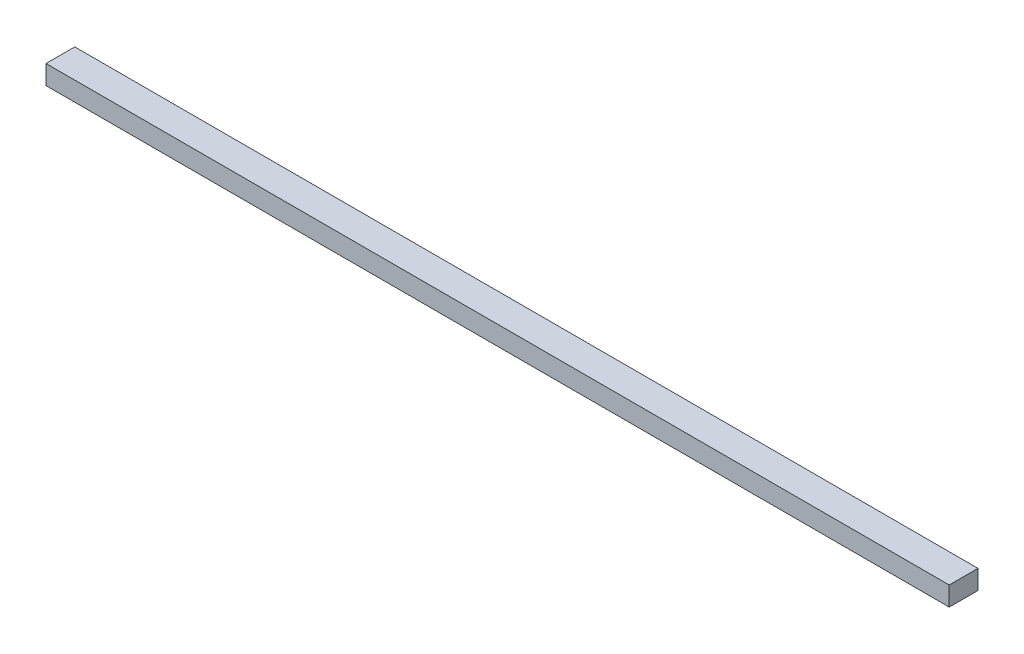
from build123d import *

# Parameters (mm, degrees)
SKETCH1_W           = 30
SKETCH1_H           = 20
BOSS_EXTRUDE1_DEPTH = 471


with BuildPart() as part:
    # Sketch1 → Boss-Extrude1 (new, symmetric)
    with BuildSketch(Plane(origin=(0, 0, 0), x_dir=(0, 0, -1), z_dir=(1, 0, 0))):
        with Locations((15, 10)):
            Rectangle(SKETCH1_W, SKETCH1_H)
    extrude(amount=BOSS_EXTRUDE1_DEPTH, both=True)


solid = part.part
